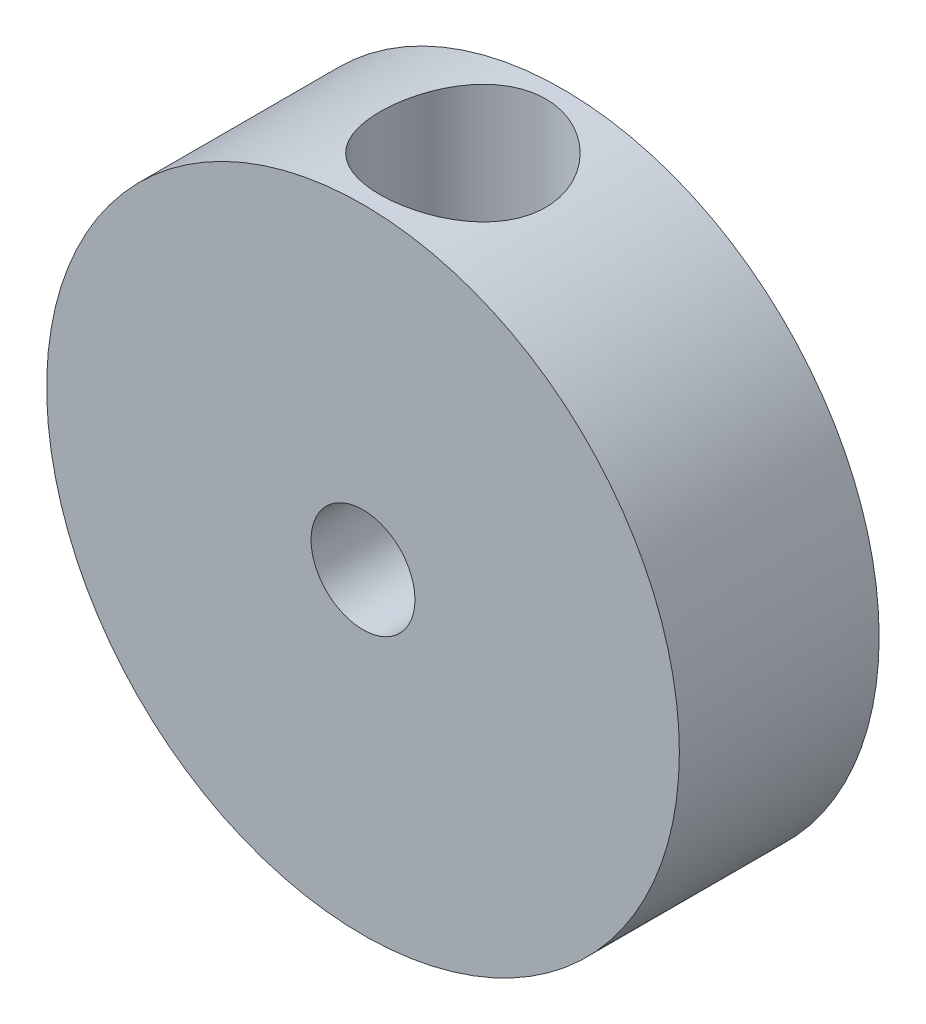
from build123d import *

# Parameters (mm, degrees)
SKETCH1_R               = 12.065
BASE_EXTRUDE_DEPTH      = 7.62
SKETCH2_R               = 3.1623
CUT_EXTRUDE1_DEPTH      = 7.62
CUT_EXTRUDE2_DEPTH      = 7.62
CUT_EXTRUDE2_DEPTH_BACK = 7.62
SKETCH3_R               = 3.1623
SKETCH4_R               = 1.9812
CUT_EXTRUDE3_DEPTH      = 19.686702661
SKETCH5_R               = 0.4445
CUT_EXTRUDE4_DEPTH      = 22.822207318


with BuildPart() as part:
    # Sketch1 → Base-Extrude (new body)
    with BuildSketch(Plane.XY):
        Circle(SKETCH1_R)
    extrude(amount=-BASE_EXTRUDE_DEPTH)

    # Sketch2 → Cut-Extrude1 (cut)
    with BuildSketch(Plane(origin=(0, 12.065, 0), x_dir=(-1, 0, 0), z_dir=(0, 1, 0))):
        with Locations(Location((0, -3.81, 0), (0, 0, 90))):
            Circle(SKETCH2_R)
    extrude(amount=-CUT_EXTRUDE1_DEPTH, mode=Mode.SUBTRACT)

    # Sketch3 → Cut-Extrude2 (cut, two sides: drawn at the far end of the back side and taken through both)
    with BuildSketch(Plane(origin=(0, -12.065, 0), x_dir=(-1, 0, 0), z_dir=(0, 1, 0)).offset(-CUT_EXTRUDE2_DEPTH_BACK)):
        with Locations(Location((0, -3.81, 0), (0, 0, 90))):
            Circle(SKETCH3_R)
    extrude(amount=CUT_EXTRUDE2_DEPTH + CUT_EXTRUDE2_DEPTH_BACK, mode=Mode.SUBTRACT)

    # Sketch4 → Cut-Extrude3 (cut, through all)
    with BuildSketch(Plane.XY):
        Circle(SKETCH4_R)
    extrude(amount=-CUT_EXTRUDE3_DEPTH, mode=Mode.SUBTRACT)

    # Sketch5 → Cut-Extrude4 (cut, through all)
    with BuildSketch(Plane(origin=(0, 4.445, 0), x_dir=(-1, 0, 0), z_dir=(0, 1, 0))):
        with Locations(Location((0, -3.81, 0), (0, 0, 90))):
            Circle(SKETCH5_R)
    extrude(amount=-CUT_EXTRUDE4_DEPTH, mode=Mode.SUBTRACT)


solid = part.part
